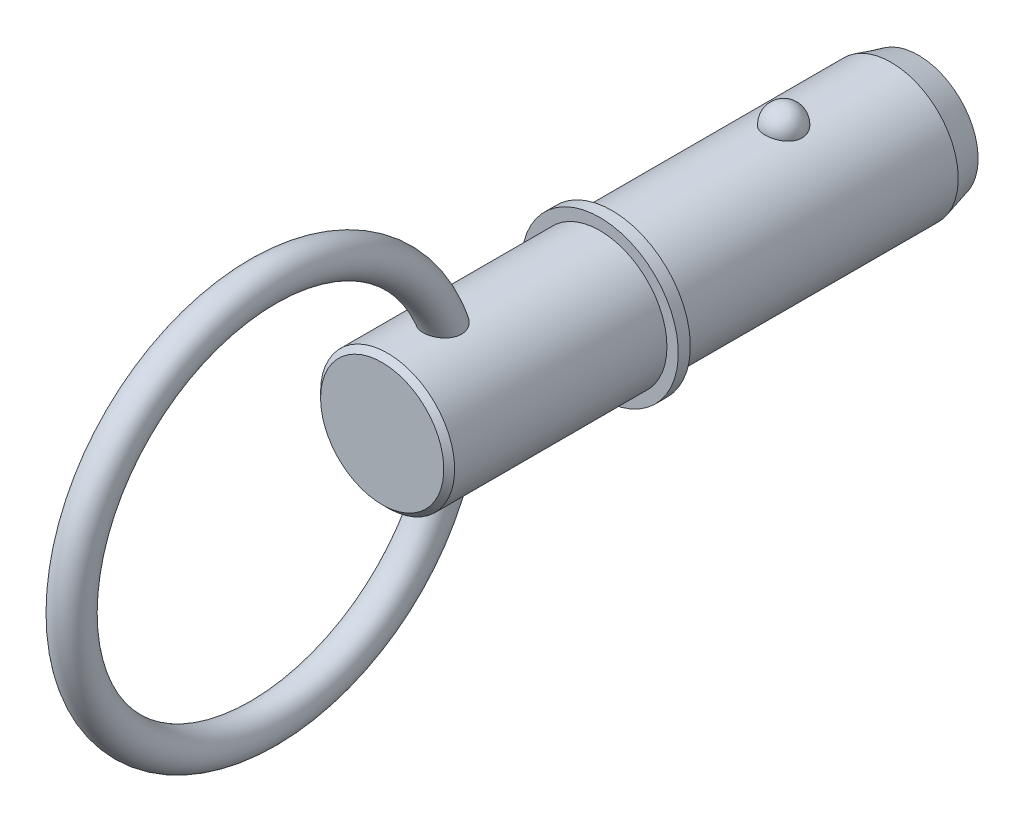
from build123d import *

# Parameters (mm, degrees)
SKETCH2_R           = 11.115
BOSS_EXTRUDE1_DEPTH = 25.4
BOSS_EXTRUDE2_START = 25.4
SKETCH3_R           = 11.115
BOSS_EXTRUDE2_DEPTH = 25.4
CHAMFER1_SIZE       = 4.5
CHAMFER1_SIZE2      = 1.205771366
SKETCH20_W          = 2
SKETCH20_H          = 13
SKETCH21_R          = 11.115
BOSS_EXTRUDE3_DEPTH = 38.1
CHAMFER2_SIZE       = 0.9
SKETCH24_R          = 3


with BuildPart() as part:
    # Sketch2 → Boss-Extrude1 (new body)
    with BuildSketch(Plane.XY):
        Circle(SKETCH2_R)
    extrude(amount=BOSS_EXTRUDE1_DEPTH)

    # Sketch3 → Boss-Extrude2 (add)
    with BuildSketch(Plane(origin=(0, 0, 0), x_dir=(-1, 0, 0), z_dir=(0, 0, -1)).offset(BOSS_EXTRUDE2_START)):
        Circle(SKETCH3_R)
    extrude(amount=-BOSS_EXTRUDE2_DEPTH)

    # Chamfer1
    chamfer1_edges = [part.edges().sort_by_distance(p)[0] for p in [
        (11.115, 0, -25.4),
    ]]
    chamfer1_side = [part.faces().sort_by_distance(p)[0] for p in [
        (11.115, 0, -12.7),
    ]]
    chamfer(chamfer1_edges, length=CHAMFER1_SIZE, length2=CHAMFER1_SIZE2, reference=chamfer1_side[0])

    # Sketch18 → Revolve1 (revolve)
    with BuildSketch(Plane(origin=(0, 0, 0), x_dir=(0, 0, -1), z_dir=(1, 0, 0))):
        with BuildLine():
            Line((3.07, 14.185), (3.07, 8.045))
            ThreePointArc((3.07, 8.045), (0, 11.115), (3.07, 14.185))
        make_face()
    revolve(axis=Axis((0, 14.185, -3.07), (0, -1, 0)))

    # Sketch20 → Revolve2 (revolve)
    with BuildSketch(Plane(origin=(0, 0, 0), x_dir=(0, 0, -1), z_dir=(1, 0, 0)), mode=Mode.PRIVATE) as revolve2_sk:
        with Locations((-26.4, 6.5)):
            Rectangle(SKETCH20_W, SKETCH20_H)
    revolve(revolve2_sk.sketch.rotate(Axis((0, 0, 33.728787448), (0, 0, 1)), 90), axis=Axis((0, 0, 33.728787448), (0, 0, 1)))

    # Sketch21 → Boss-Extrude3 (add)
    with BuildSketch(Plane(origin=(0, 0, 25.4), x_dir=(-1, 0, 0), z_dir=(0, 0, -1))):
        Circle(SKETCH21_R)
    extrude(amount=-BOSS_EXTRUDE3_DEPTH)

    # Chamfer2
    chamfer2_edges = [part.edges().sort_by_distance(p)[0] for p in [
        (11.115, 0, 63.5),
    ]]
    chamfer(chamfer2_edges, length=CHAMFER2_SIZE)

    # Sweep1: sweep along a path in Sketch23
    with BuildLine(Plane(origin=(0, 0, 0), x_dir=(0, 0, -1), z_dir=(1, 0, 0))) as sweep1_path:
        CenterArc((-83.25, 0), 31.75, 0, 360)
    # Sketch24 → Sweep1 (sweep)
    with BuildSketch(Plane(origin=(0, 0, 0), x_dir=(1, 0, 0), z_dir=(0, 1, 0))):
        with Locations((0, -51.5)):
            Circle(SKETCH24_R)
    sweep(path=sweep1_path.line)


solid = part.part
